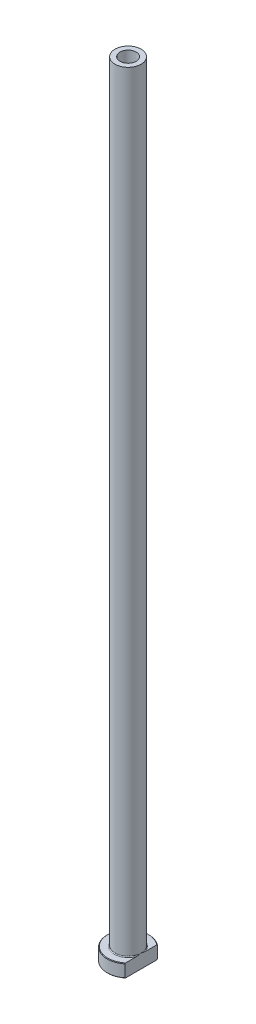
ISO-10303-21;
HEADER;
FILE_DESCRIPTION(('STEP AP214'),'2;1');
FILE_NAME('part.step','',(''),(''),'','','');
FILE_SCHEMA(('AUTOMOTIVE_DESIGN { 1 0 10303 214 1 1 1 1 }'));
ENDSEC;
DATA;
#1=APPLICATION_CONTEXT('core data for automotive mechanical design processes');
#2=APPLICATION_PROTOCOL_DEFINITION('international standard','automotive_design',2000,#1);
#3=PRODUCT_CONTEXT('',#1,'mechanical');
#4=PRODUCT('Part','Part','',(#3));
#5=PRODUCT_RELATED_PRODUCT_CATEGORY('part','',(#4));
#6=PRODUCT_DEFINITION_FORMATION('','',#4);
#7=PRODUCT_DEFINITION_CONTEXT('part definition',#1,'design');
#8=PRODUCT_DEFINITION('design','',#6,#7);
#9=PRODUCT_DEFINITION_SHAPE('','',#8);
#10=(LENGTH_UNIT() NAMED_UNIT(*) SI_UNIT(.MILLI.,.METRE.));
#11=(NAMED_UNIT(*) PLANE_ANGLE_UNIT() SI_UNIT($,.RADIAN.));
#12=(NAMED_UNIT(*) SI_UNIT($,.STERADIAN.) SOLID_ANGLE_UNIT());
#13=UNCERTAINTY_MEASURE_WITH_UNIT(LENGTH_MEASURE(1.E-05),#10,'distance_accuracy_value','');
#14=(GEOMETRIC_REPRESENTATION_CONTEXT(3) GLOBAL_UNCERTAINTY_ASSIGNED_CONTEXT((#13)) GLOBAL_UNIT_ASSIGNED_CONTEXT((#10,
#11,#12)) REPRESENTATION_CONTEXT('',''));
#15=CARTESIAN_POINT('',(0.,0.,0.));
#16=DIRECTION('',(0.,0.,1.));
#17=DIRECTION('',(1.,0.,0.));
#18=AXIS2_PLACEMENT_3D('',#15,#16,#17);
#19=CARTESIAN_POINT('',(0.,92.1876809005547,0.));
#20=DIRECTION('',(0.,1.,0.));
#21=DIRECTION('',(0.,0.,1.));
#22=AXIS2_PLACEMENT_3D('',#19,#20,#21);
#23=CYLINDRICAL_SURFACE('',#22,3.10000000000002);
#24=CARTESIAN_POINT('',(0.,300.,0.));
#25=DIRECTION('',(0.,1.,0.));
#26=DIRECTION('',(0.,0.,1.));
#27=AXIS2_PLACEMENT_3D('',#24,#25,#26);
#28=CIRCLE('',#27,3.10000000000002);
#29=CARTESIAN_POINT('',(0.,300.,3.10000000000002));
#30=VERTEX_POINT('',#29);
#31=EDGE_CURVE('E167',#30,#30,#28,.T.);
#32=ORIENTED_EDGE('',*,*,#31,.T.);
#33=EDGE_LOOP('',(#32));
#34=FACE_BOUND('',#33,.T.);
#35=CARTESIAN_POINT('',(0.,255.,0.));
#36=DIRECTION('',(0.,1.,0.));
#37=DIRECTION('',(0.,0.,1.));
#38=AXIS2_PLACEMENT_3D('',#35,#36,#37);
#39=CIRCLE('',#38,3.10000000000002);
#40=CARTESIAN_POINT('',(0.,255.,3.10000000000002));
#41=VERTEX_POINT('',#40);
#42=EDGE_CURVE('E170',#41,#41,#39,.T.);
#43=ORIENTED_EDGE('',*,*,#42,.F.);
#44=EDGE_LOOP('',(#43));
#45=FACE_BOUND('',#44,.T.);
#46=ADVANCED_FACE('F32',(#34,#45),#23,.F.);
#47=CARTESIAN_POINT('',(-3.10000000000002,300.,0.));
#48=DIRECTION('',(0.,1.,0.));
#49=DIRECTION('',(0.,0.,1.));
#50=AXIS2_PLACEMENT_3D('',#47,#48,#49);
#51=PLANE('',#50);
#52=CARTESIAN_POINT('',(0.,300.,0.));
#53=DIRECTION('',(0.,1.,0.));
#54=DIRECTION('',(0.,0.,1.));
#55=AXIS2_PLACEMENT_3D('',#52,#53,#54);
#56=CIRCLE('',#55,5.00000000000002);
#57=CARTESIAN_POINT('',(0.,300.,5.00000000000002));
#58=VERTEX_POINT('',#57);
#59=EDGE_CURVE('E174',#58,#58,#56,.T.);
#60=ORIENTED_EDGE('',*,*,#59,.T.);
#61=EDGE_LOOP('',(#60));
#62=FACE_BOUND('',#61,.T.);
#63=ORIENTED_EDGE('',*,*,#31,.F.);
#64=EDGE_LOOP('',(#63));
#65=FACE_BOUND('',#64,.T.);
#66=ADVANCED_FACE('F157',(#62,#65),#51,.T.);
#67=CARTESIAN_POINT('',(0.,92.1876809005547,0.));
#68=DIRECTION('',(0.,1.,0.));
#69=DIRECTION('',(0.,0.,1.));
#70=AXIS2_PLACEMENT_3D('',#67,#68,#69);
#71=CYLINDRICAL_SURFACE('',#70,5.00000000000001);
#72=CARTESIAN_POINT('',(0.,5.3,0.));
#73=DIRECTION('',(0.,1.,0.));
#74=DIRECTION('',(0.,0.,1.));
#75=AXIS2_PLACEMENT_3D('',#72,#73,#74);
#76=CIRCLE('',#75,5.00000000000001);
#77=CARTESIAN_POINT('',(5.,5.3,0.));
#78=VERTEX_POINT('',#77);
#79=EDGE_CURVE('E180',#78,#78,#76,.T.);
#80=ORIENTED_EDGE('',*,*,#79,.T.);
#81=EDGE_LOOP('',(#80));
#82=FACE_BOUND('',#81,.T.);
#83=ORIENTED_EDGE('',*,*,#59,.F.);
#84=EDGE_LOOP('',(#83));
#85=FACE_BOUND('',#84,.T.);
#86=ADVANCED_FACE('F162',(#82,#85),#71,.T.);
#87=CARTESIAN_POINT('',(-4.99999999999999,5.,0.));
#88=DIRECTION('',(0.,1.,0.));
#89=DIRECTION('',(0.,0.,1.));
#90=AXIS2_PLACEMENT_3D('',#87,#88,#89);
#91=PLANE('',#90);
#92=DIRECTION('',(0.,0.,1.));
#93=VECTOR('',#92,1.);
#94=CARTESIAN_POINT('',(5.,5.,0.));
#95=LINE('',#94,#93);
#96=CARTESIAN_POINT('',(5.,5.,-5.98665181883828));
#97=VERTEX_POINT('',#96);
#98=CARTESIAN_POINT('',(5.,5.,-1.75783958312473));
#99=VERTEX_POINT('',#98);
#100=EDGE_CURVE('E54',#97,#99,#95,.T.);
#101=ORIENTED_EDGE('',*,*,#100,.F.);
#102=CARTESIAN_POINT('',(0.,5.,0.));
#103=DIRECTION('',(0.,1.,0.));
#104=DIRECTION('',(0.,0.,1.));
#105=AXIS2_PLACEMENT_3D('',#102,#103,#104);
#106=CIRCLE('',#105,7.79999999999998);
#107=CARTESIAN_POINT('',(4.99999999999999,5.,5.98665181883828));
#108=VERTEX_POINT('',#107);
#109=EDGE_CURVE('E186',#97,#108,#106,.T.);
#110=ORIENTED_EDGE('',*,*,#109,.T.);
#111=CARTESIAN_POINT('',(5.,5.,1.75783958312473));
#112=VERTEX_POINT('',#111);
#113=EDGE_CURVE('E134',#112,#108,#95,.T.);
#114=ORIENTED_EDGE('',*,*,#113,.F.);
#115=CARTESIAN_POINT('',(0.,5.,0.));
#116=DIRECTION('',(0.,1.,0.));
#117=DIRECTION('',(0.,0.,1.));
#118=AXIS2_PLACEMENT_3D('',#115,#116,#117);
#119=CIRCLE('',#118,5.30000000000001);
#120=EDGE_CURVE('E183',#112,#99,#119,.F.);
#121=ORIENTED_EDGE('',*,*,#120,.T.);
#122=EDGE_LOOP('',(#101,#110,#114,#121));
#123=FACE_BOUND('',#122,.T.);
#124=ADVANCED_FACE('F197',(#123),#91,.T.);
#125=CARTESIAN_POINT('',(0.,92.1876809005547,0.));
#126=DIRECTION('',(0.,1.,0.));
#127=DIRECTION('',(0.,0.,1.));
#128=AXIS2_PLACEMENT_3D('',#125,#126,#127);
#129=CYLINDRICAL_SURFACE('',#128,7.99999999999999);
#130=DIRECTION('',(0.,-1.,0.));
#131=VECTOR('',#130,1.);
#132=CARTESIAN_POINT('',(4.99999999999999,300.,6.24499799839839));
#133=LINE('',#132,#131);
#134=CARTESIAN_POINT('',(4.99999999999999,4.79999999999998,6.24499799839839));
#135=VERTEX_POINT('',#134);
#136=CARTESIAN_POINT('',(4.99999999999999,0.199999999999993,6.24499799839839));
#137=VERTEX_POINT('',#136);
#138=EDGE_CURVE('E82',#135,#137,#133,.T.);
#139=ORIENTED_EDGE('',*,*,#138,.F.);
#140=CARTESIAN_POINT('',(0.,4.79999999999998,0.));
#141=DIRECTION('',(0.,1.,0.));
#142=DIRECTION('',(0.,0.,1.));
#143=AXIS2_PLACEMENT_3D('',#140,#141,#142);
#144=CIRCLE('',#143,7.99999999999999);
#145=CARTESIAN_POINT('',(5.,4.79999999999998,-6.24499799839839));
#146=VERTEX_POINT('',#145);
#147=EDGE_CURVE('E95',#135,#146,#144,.F.);
#148=ORIENTED_EDGE('',*,*,#147,.T.);
#149=DIRECTION('',(0.,-1.,0.));
#150=VECTOR('',#149,1.);
#151=CARTESIAN_POINT('',(5.,300.,-6.24499799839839));
#152=LINE('',#151,#150);
#153=CARTESIAN_POINT('',(5.,0.199999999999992,-6.24499799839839));
#154=VERTEX_POINT('',#153);
#155=EDGE_CURVE('E192',#146,#154,#152,.T.);
#156=ORIENTED_EDGE('',*,*,#155,.T.);
#157=CARTESIAN_POINT('',(0.,0.199999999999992,0.));
#158=DIRECTION('',(0.,-1.,0.));
#159=DIRECTION('',(0.,0.,-1.));
#160=AXIS2_PLACEMENT_3D('',#157,#158,#159);
#161=CIRCLE('',#160,7.99999999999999);
#162=EDGE_CURVE('E98',#154,#137,#161,.F.);
#163=ORIENTED_EDGE('',*,*,#162,.T.);
#164=EDGE_LOOP('',(#139,#148,#156,#163));
#165=FACE_BOUND('',#164,.T.);
#166=ADVANCED_FACE('F190',(#165),#129,.T.);
#167=CARTESIAN_POINT('',(-7.99999999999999,0.,0.));
#168=DIRECTION('',(0.,-1.,0.));
#169=DIRECTION('',(0.,0.,-1.));
#170=AXIS2_PLACEMENT_3D('',#167,#168,#169);
#171=PLANE('',#170);
#172=CARTESIAN_POINT('',(0.,0.,0.));
#173=DIRECTION('',(0.,-1.,0.));
#174=DIRECTION('',(0.,0.,-1.));
#175=AXIS2_PLACEMENT_3D('',#172,#173,#174);
#176=CIRCLE('',#175,3.84999999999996);
#177=CARTESIAN_POINT('',(0.,0.,-3.84999999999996));
#178=VERTEX_POINT('',#177);
#179=EDGE_CURVE('E40',#178,#178,#176,.F.);
#180=ORIENTED_EDGE('',*,*,#179,.T.);
#181=EDGE_LOOP('',(#180));
#182=FACE_BOUND('',#181,.T.);
#183=DIRECTION('',(0.,0.,-1.));
#184=VECTOR('',#183,1.);
#185=CARTESIAN_POINT('',(4.99999999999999,0.,6.24499799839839));
#186=LINE('',#185,#184);
#187=CARTESIAN_POINT('',(4.99999999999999,0.,5.98665181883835));
#188=VERTEX_POINT('',#187);
#189=CARTESIAN_POINT('',(5.,0.,-5.98665181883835));
#190=VERTEX_POINT('',#189);
#191=EDGE_CURVE('E47',#188,#190,#186,.T.);
#192=ORIENTED_EDGE('',*,*,#191,.F.);
#193=CARTESIAN_POINT('',(0.,0.,0.));
#194=DIRECTION('',(0.,-1.,0.));
#195=DIRECTION('',(0.,0.,-1.));
#196=AXIS2_PLACEMENT_3D('',#193,#194,#195);
#197=CIRCLE('',#196,7.80000000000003);
#198=EDGE_CURVE('E92',#188,#190,#197,.T.);
#199=ORIENTED_EDGE('',*,*,#198,.T.);
#200=EDGE_LOOP('',(#192,#199));
#201=FACE_BOUND('',#200,.T.);
#202=ADVANCED_FACE('F91',(#182,#201),#171,.T.);
#203=CARTESIAN_POINT('',(0.,92.1876809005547,0.));
#204=DIRECTION('',(0.,1.,0.));
#205=DIRECTION('',(0.,0.,1.));
#206=AXIS2_PLACEMENT_3D('',#203,#204,#205);
#207=CYLINDRICAL_SURFACE('',#206,3.35);
#208=CARTESIAN_POINT('',(0.,0.499999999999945,0.));
#209=DIRECTION('',(0.,-1.,0.));
#210=DIRECTION('',(0.,0.,-1.));
#211=AXIS2_PLACEMENT_3D('',#208,#209,#210);
#212=CIRCLE('',#211,3.35);
#213=CARTESIAN_POINT('',(0.,0.499999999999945,-3.35));
#214=VERTEX_POINT('',#213);
#215=EDGE_CURVE('E11',#214,#214,#212,.T.);
#216=ORIENTED_EDGE('',*,*,#215,.T.);
#217=EDGE_LOOP('',(#216));
#218=FACE_BOUND('',#217,.T.);
#219=CARTESIAN_POINT('',(0.,243.,0.));
#220=DIRECTION('',(0.,1.,0.));
#221=DIRECTION('',(0.,0.,1.));
#222=AXIS2_PLACEMENT_3D('',#219,#220,#221);
#223=CIRCLE('',#222,3.35000000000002);
#224=CARTESIAN_POINT('',(0.,243.,3.35000000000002));
#225=VERTEX_POINT('',#224);
#226=EDGE_CURVE('E172',#225,#225,#223,.T.);
#227=ORIENTED_EDGE('',*,*,#226,.T.);
#228=EDGE_LOOP('',(#227));
#229=FACE_BOUND('',#228,.T.);
#230=ADVANCED_FACE('F215',(#218,#229),#207,.F.);
#231=CARTESIAN_POINT('',(0.,243.,0.));
#232=DIRECTION('',(0.,-1.,0.));
#233=DIRECTION('',(0.,0.,-1.));
#234=AXIS2_PLACEMENT_3D('',#231,#232,#233);
#235=CONICAL_SURFACE('',#234,3.35000000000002,0.0208303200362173);
#236=ORIENTED_EDGE('',*,*,#42,.T.);
#237=EDGE_LOOP('',(#236));
#238=FACE_BOUND('',#237,.T.);
#239=ORIENTED_EDGE('',*,*,#226,.F.);
#240=EDGE_LOOP('',(#239));
#241=FACE_BOUND('',#240,.T.);
#242=ADVANCED_FACE('F111',(#238,#241),#235,.F.);
#243=CARTESIAN_POINT('',(0.,5.3,0.));
#244=DIRECTION('',(0.,1.,0.));
#245=DIRECTION('',(0.,0.,1.));
#246=AXIS2_PLACEMENT_3D('',#243,#244,#245);
#247=TOROIDAL_SURFACE('',#246,5.30000000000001,0.3);
#248=ORIENTED_EDGE('',*,*,#120,.F.);
#249=CARTESIAN_POINT('',(5.,5.3,0.));
#250=CARTESIAN_POINT('',(5.,5.30000062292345,-1.31469010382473E-10));
#251=CARTESIAN_POINT('',(5.,5.30000124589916,2.52759437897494E-07));
#252=CARTESIAN_POINT('',(5.,5.30000240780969,9.47164796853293E-07));
#253=CARTESIAN_POINT('',(5.,5.30000293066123,1.40594088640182E-06));
#254=CARTESIAN_POINT('',(5.,5.30000402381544,2.50637678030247E-06));
#255=CARTESIAN_POINT('',(5.,5.30000457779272,3.16588995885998E-06));
#256=CARTESIAN_POINT('',(5.,5.3000055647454,4.52860063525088E-06));
#257=CARTESIAN_POINT('',(5.,5.30000600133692,5.22939539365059E-06));
#258=CARTESIAN_POINT('',(5.,5.30000763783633,7.96122138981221E-06));
#259=CARTESIAN_POINT('',(5.,5.30000875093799,1.00477429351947E-05));
#260=CARTESIAN_POINT('',(5.,5.30001056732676,1.41660896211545E-05));
#261=CARTESIAN_POINT('',(5.,5.30001129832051,1.61861803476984E-05));
#262=CARTESIAN_POINT('',(5.,5.30001439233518,2.47865774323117E-05));
#263=CARTESIAN_POINT('',(5.,5.30001672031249,3.13830329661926E-05));
#264=CARTESIAN_POINT('',(5.,5.30002012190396,4.38084273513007E-05));
#265=CARTESIAN_POINT('',(5.,5.30002133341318,4.95992786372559E-05));
#266=CARTESIAN_POINT('',(4.99999999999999,5.30003020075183,9.27862687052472E-05));
#267=CARTESIAN_POINT('',(5.,5.30003696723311,0.000130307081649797));
#268=CARTESIAN_POINT('',(5.,5.30006659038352,0.000278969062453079));
#269=CARTESIAN_POINT('',(5.,5.30009481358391,0.000389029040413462));
#270=CARTESIAN_POINT('',(4.99999999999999,5.30020506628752,0.000826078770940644));
#271=CARTESIAN_POINT('',(5.,5.30028365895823,0.00115365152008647));
#272=CARTESIAN_POINT('',(5.,5.30059919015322,0.00245925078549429));
#273=CARTESIAN_POINT('',(5.,5.3008404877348,0.00343651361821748));
#274=CARTESIAN_POINT('',(4.99999999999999,5.30184626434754,0.00752058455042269));
#275=CARTESIAN_POINT('',(4.99999999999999,5.30260525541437,0.0106283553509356));
#276=CARTESIAN_POINT('',(5.,5.30996461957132,0.0407482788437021));
#277=CARTESIAN_POINT('',(5.,5.31658985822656,0.0677561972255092));
#278=CARTESIAN_POINT('',(4.99999999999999,5.32953319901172,0.120688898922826));
#279=CARTESIAN_POINT('',(5.,5.33585289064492,0.146613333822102));
#280=CARTESIAN_POINT('',(5.,5.34926050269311,0.20179565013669));
#281=CARTESIAN_POINT('',(5.,5.35634306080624,0.231054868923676));
#282=CARTESIAN_POINT('',(5.,5.37050252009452,0.289917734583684));
#283=CARTESIAN_POINT('',(5.,5.37757848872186,0.319521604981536));
#284=CARTESIAN_POINT('',(5.,5.39452602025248,0.391032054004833));
#285=CARTESIAN_POINT('',(5.,5.40434071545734,0.432952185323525));
#286=CARTESIAN_POINT('',(5.,5.42340141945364,0.515763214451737));
#287=CARTESIAN_POINT('',(5.,5.43265559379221,0.556652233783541));
#288=CARTESIAN_POINT('',(5.,5.45710553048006,0.667075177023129));
#289=CARTESIAN_POINT('',(5.,5.47194176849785,0.736689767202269));
#290=CARTESIAN_POINT('',(5.,5.5001822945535,0.876836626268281));
#291=CARTESIAN_POINT('',(5.,5.51357312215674,0.947371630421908));
#292=CARTESIAN_POINT('',(5.,5.53930921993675,1.0949732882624));
#293=CARTESIAN_POINT('',(5.,5.5514621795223,1.17207432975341));
#294=CARTESIAN_POINT('',(5.,5.57239669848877,1.32672649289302));
#295=CARTESIAN_POINT('',(5.,5.58117877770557,1.40427754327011));
#296=CARTESIAN_POINT('',(5.,5.59499725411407,1.56873827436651));
#297=CARTESIAN_POINT('',(5.,5.59948802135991,1.65570044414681));
#298=CARTESIAN_POINT('',(5.,5.60018885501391,1.78535304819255));
#299=CARTESIAN_POINT('',(5.,5.59945214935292,1.82802575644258));
#300=CARTESIAN_POINT('',(5.,5.59559364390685,1.91325081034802));
#301=CARTESIAN_POINT('',(5.,5.59247319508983,1.95580321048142));
#302=CARTESIAN_POINT('',(5.,5.58383242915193,2.03512365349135));
#303=CARTESIAN_POINT('',(5.,5.57867386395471,2.07192937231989));
#304=CARTESIAN_POINT('',(5.,5.56543793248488,2.14526756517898));
#305=CARTESIAN_POINT('',(5.,5.55734203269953,2.18179676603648));
#306=CARTESIAN_POINT('',(5.,5.53718005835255,2.25427226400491));
#307=CARTESIAN_POINT('',(5.,5.52507057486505,2.29020746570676));
#308=CARTESIAN_POINT('',(5.,5.50270928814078,2.34223029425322));
#309=CARTESIAN_POINT('',(5.,5.4945781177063,2.35922314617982));
#310=CARTESIAN_POINT('',(5.,5.47657809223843,2.39224900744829));
#311=CARTESIAN_POINT('',(5.,5.4667128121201,2.40828390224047));
#312=CARTESIAN_POINT('',(5.,5.44695893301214,2.4357946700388));
#313=CARTESIAN_POINT('',(5.,5.43745879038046,2.44754592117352));
#314=CARTESIAN_POINT('',(5.,5.41677914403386,2.46946476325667));
#315=CARTESIAN_POINT('',(5.,5.40560543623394,2.47963758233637));
#316=CARTESIAN_POINT('',(5.,5.38617750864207,2.49393642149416));
#317=CARTESIAN_POINT('',(5.,5.37851643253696,2.49886271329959));
#318=CARTESIAN_POINT('',(5.,5.36252740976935,2.50749953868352));
#319=CARTESIAN_POINT('',(5.,5.35419984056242,2.51121075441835));
#320=CARTESIAN_POINT('',(5.,5.33690648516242,2.51712941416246));
#321=CARTESIAN_POINT('',(5.,5.32793451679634,2.51931927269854));
#322=CARTESIAN_POINT('',(5.,5.3097357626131,2.52185978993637));
#323=CARTESIAN_POINT('',(5.,5.30050931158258,2.52221275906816));
#324=CARTESIAN_POINT('',(5.,5.28349166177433,2.52112455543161));
#325=CARTESIAN_POINT('',(5.,5.2756832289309,2.51993178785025));
#326=CARTESIAN_POINT('',(5.,5.26036860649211,2.51628294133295));
#327=CARTESIAN_POINT('',(5.,5.25286261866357,2.51382603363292));
#328=CARTESIAN_POINT('',(5.,5.23590266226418,2.50685484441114));
#329=CARTESIAN_POINT('',(5.,5.22661875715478,2.50192984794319));
#330=CARTESIAN_POINT('',(5.,5.20895514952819,2.49066548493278));
#331=CARTESIAN_POINT('',(5.,5.20057756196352,2.48432291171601));
#332=CARTESIAN_POINT('',(5.,5.17987008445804,2.46645212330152));
#333=CARTESIAN_POINT('',(5.,5.16824151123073,2.45411867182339));
#334=CARTESIAN_POINT('',(5.,5.14692461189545,2.42790849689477));
#335=CARTESIAN_POINT('',(5.,5.13723987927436,2.41402898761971));
#336=CARTESIAN_POINT('',(5.,5.11080706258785,2.37143175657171));
#337=CARTESIAN_POINT('',(5.,5.09628770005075,2.34134703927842));
#338=CARTESIAN_POINT('',(5.,5.07130349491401,2.27940731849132));
#339=CARTESIAN_POINT('',(5.,5.06087110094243,2.24754035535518));
#340=CARTESIAN_POINT('',(5.,5.03890359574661,2.16787245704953));
#341=CARTESIAN_POINT('',(5.,5.02913523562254,2.11959065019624));
#342=CARTESIAN_POINT('',(5.,5.01416953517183,2.02224928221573));
#343=CARTESIAN_POINT('',(5.,5.00898637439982,1.97318778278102));
#344=CARTESIAN_POINT('',(5.,5.00220823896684,1.87635767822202));
#345=CARTESIAN_POINT('',(5.,5.00050709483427,1.82859609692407));
#346=CARTESIAN_POINT('',(5.,4.99969104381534,1.73330165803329));
#347=CARTESIAN_POINT('',(5.,5.00056327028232,1.6857688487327));
#348=CARTESIAN_POINT('',(5.,5.00484296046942,1.57937770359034));
#349=CARTESIAN_POINT('',(5.,5.00880932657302,1.52054285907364));
#350=CARTESIAN_POINT('',(5.,5.01925964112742,1.40312974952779));
#351=CARTESIAN_POINT('',(5.,5.0257426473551,1.34455139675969));
#352=CARTESIAN_POINT('',(5.,5.04090087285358,1.22627662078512));
#353=CARTESIAN_POINT('',(5.,5.0496242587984,1.16658647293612));
#354=CARTESIAN_POINT('',(5.,5.06877923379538,1.04732463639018));
#355=CARTESIAN_POINT('',(5.,5.07921523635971,0.987753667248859));
#356=CARTESIAN_POINT('',(5.,5.10551698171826,0.846936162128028));
#357=CARTESIAN_POINT('',(5.,5.12196565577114,0.765799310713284));
#358=CARTESIAN_POINT('',(5.,5.15639716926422,0.604819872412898));
#359=CARTESIAN_POINT('',(4.99999999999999,5.17436050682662,0.52497303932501));
#360=CARTESIAN_POINT('',(5.,5.20921667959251,0.374726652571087));
#361=CARTESIAN_POINT('',(5.,5.225993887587,0.304300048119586));
#362=CARTESIAN_POINT('',(4.99999999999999,5.25191105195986,0.196907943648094));
#363=CARTESIAN_POINT('',(4.99999999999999,5.26090146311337,0.159905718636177));
#364=CARTESIAN_POINT('',(5.,5.27881854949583,0.0865164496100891));
#365=CARTESIAN_POINT('',(5.00000000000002,5.28774391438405,0.0501291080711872));
#366=CARTESIAN_POINT('',(4.99999999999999,5.2973962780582,0.0106218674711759));
#367=CARTESIAN_POINT('',(4.99999999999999,5.29815688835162,0.00750762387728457));
#368=CARTESIAN_POINT('',(5.,5.29916304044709,0.00342209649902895));
#369=CARTESIAN_POINT('',(5.,5.29940309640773,0.00244985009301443));
#370=CARTESIAN_POINT('',(4.99999999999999,5.29971711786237,0.00115049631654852));
#371=CARTESIAN_POINT('',(4.99999999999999,5.29979541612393,0.000824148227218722));
#372=CARTESIAN_POINT('',(5.,5.29990531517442,0.000388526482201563));
#373=CARTESIAN_POINT('',(5.,5.29993348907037,0.000278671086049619));
#374=CARTESIAN_POINT('',(4.99999999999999,5.29996306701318,0.000130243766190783));
#375=CARTESIAN_POINT('',(4.99999999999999,5.2999698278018,9.27511452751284E-05));
#376=CARTESIAN_POINT('',(5.,5.29997868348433,4.95929937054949E-05));
#377=CARTESIAN_POINT('',(5.,5.2999798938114,4.38036608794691E-05));
#378=CARTESIAN_POINT('',(5.,5.29998329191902,3.13814231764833E-05));
#379=CARTESIAN_POINT('',(5.,5.29998561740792,2.47865253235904E-05));
#380=CARTESIAN_POINT('',(5.,5.29998870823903,1.61877567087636E-05));
#381=CARTESIAN_POINT('',(5.,5.29998943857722,1.41677791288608E-05));
#382=CARTESIAN_POINT('',(5.,5.29999125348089,1.00495550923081E-05));
#383=CARTESIAN_POINT('',(5.,5.29999236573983,7.96302814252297E-06));
#384=CARTESIAN_POINT('',(5.,5.29999400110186,5.23107510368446E-06));
#385=CARTESIAN_POINT('',(5.,5.2999944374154,4.53021132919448E-06));
#386=CARTESIAN_POINT('',(5.,5.29999542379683,3.16731243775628E-06));
#387=CARTESIAN_POINT('',(5.,5.29999597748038,2.50767799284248E-06));
#388=CARTESIAN_POINT('',(5.,5.29999707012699,1.40695930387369E-06));
#389=CARTESIAN_POINT('',(5.,5.29999759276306,9.48032903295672E-07));
#390=CARTESIAN_POINT('',(5.,5.29999875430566,2.53244546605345E-07));
#391=CARTESIAN_POINT('',(5.,5.29999937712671,1.31459812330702E-10));
#392=CARTESIAN_POINT('',(5.,5.3,0.));
#393=B_SPLINE_CURVE_WITH_KNOTS('',3,(#249,#250,#251,#252,#253,#254,#255,#256,#257,#258,#259,
#260,#261,#262,#263,#264,#265,#266,#267,#268,#269,#270,#271,#272,#273,#274,#275,#276,#277,#278,
#279,#280,#281,#282,#283,#284,#285,#286,#287,#288,#289,#290,#291,#292,#293,#294,#295,#296,#297,
#298,#299,#300,#301,#302,#303,#304,#305,#306,#307,#308,#309,#310,#311,#312,#313,#314,#315,#316,
#317,#318,#319,#320,#321,#322,#323,#324,#325,#326,#327,#328,#329,#330,#331,#332,#333,#334,#335,
#336,#337,#338,#339,#340,#341,#342,#343,#344,#345,#346,#347,#348,#349,#350,#351,#352,#353,#354,
#355,#356,#357,#358,#359,#360,#361,#362,#363,#364,#365,#366,#367,#368,#369,#370,#371,#372,#373,
#374,#375,#376,#377,#378,#379,#380,#381,#382,#383,#384,#385,#386,#387,#388,#389,#390,#391,#392),
.UNSPECIFIED.,.T.,.F.,(4,2,2,2,2,2,2,2,2,2,2,2,2,2,2,2,2,2,2,2,2,2,2,2,2,2,2,2,2,2,2,2,2,2,2,2,
2,2,2,2,2,2,2,2,2,2,2,2,2,2,2,2,2,2,2,2,2,2,2,2,2,2,2,2,2,2,2,2,2,2,2,4),(0.,
1.88939046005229E-06,3.98058434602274E-06,6.54817954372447E-06,9.02403619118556E-06,
1.60938663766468E-05,2.25328087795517E-05,4.34843817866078E-05,6.12120063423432E-05,
0.00017562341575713,0.000516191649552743,0.00152710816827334,0.00454656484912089,
0.0141443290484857,0.0975679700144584,0.17761933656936,0.267931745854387,0.359245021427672,
0.488405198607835,0.614173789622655,0.827694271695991,1.04305715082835,1.27715608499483,
1.51121890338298,1.77214751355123,1.90013509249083,2.02805018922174,2.13945459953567,
2.25157451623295,2.3649489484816,2.42139235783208,2.47772074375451,2.5229380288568,
2.56800219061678,2.59524342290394,2.62246933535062,2.65000494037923,2.67750590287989,
2.70108948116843,2.72468854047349,2.75603978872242,2.78746268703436,2.83802806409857,
2.88868607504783,2.98834295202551,3.08877575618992,3.23618650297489,3.38405153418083,
3.52733651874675,3.66990630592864,3.84673903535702,4.02350562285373,4.20444776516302,
4.38586374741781,4.63419556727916,4.87971270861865,5.09690175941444,5.21113882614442,
5.32353360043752,5.33315137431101,5.33615533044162,5.33716246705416,5.33750240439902,
5.3376167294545,5.33763445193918,5.33765539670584,5.33766183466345,5.33766890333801,
5.33767137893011,5.33767394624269,5.33767603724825,5.33767792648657),.UNSPECIFIED.);
#394=EDGE_CURVE('E126',#112,#78,#393,.T.);
#395=ORIENTED_EDGE('',*,*,#394,.T.);
#396=ORIENTED_EDGE('',*,*,#79,.F.);
#397=CARTESIAN_POINT('',(5.,5.3,0.));
#398=CARTESIAN_POINT('',(5.,5.29999937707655,1.31470487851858E-10));
#399=CARTESIAN_POINT('',(5.,5.29999875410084,-2.52759436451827E-07));
#400=CARTESIAN_POINT('',(5.,5.29999759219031,-9.47164795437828E-07));
#401=CARTESIAN_POINT('',(5.,5.29999706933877,-1.40594088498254E-06));
#402=CARTESIAN_POINT('',(5.,5.29999597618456,-2.50637677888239E-06));
#403=CARTESIAN_POINT('',(5.,5.29999542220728,-3.16588995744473E-06));
#404=CARTESIAN_POINT('',(5.,5.29999443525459,-4.52860063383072E-06));
#405=CARTESIAN_POINT('',(5.,5.29999399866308,-5.22939539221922E-06));
#406=CARTESIAN_POINT('',(5.,5.29999236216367,-7.96122138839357E-06));
#407=CARTESIAN_POINT('',(5.,5.299991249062,-1.00477429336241E-05));
#408=CARTESIAN_POINT('',(5.,5.29998943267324,-1.4166089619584E-05));
#409=CARTESIAN_POINT('',(5.,5.29998870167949,-1.61861803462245E-05));
#410=CARTESIAN_POINT('',(5.,5.29998560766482,-2.47865774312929E-05));
#411=CARTESIAN_POINT('',(5.,5.29998327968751,-3.13830329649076E-05));
#412=CARTESIAN_POINT('',(5.,5.29997987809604,-4.38084273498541E-05));
#413=CARTESIAN_POINT('',(5.,5.29997866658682,-4.95992786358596E-05));
#414=CARTESIAN_POINT('',(5.,5.29996979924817,-9.27862687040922E-05));
#415=CARTESIAN_POINT('',(5.,5.29996303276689,-0.00013030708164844));
#416=CARTESIAN_POINT('',(4.99999999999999,5.29993340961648,-0.000278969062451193));
#417=CARTESIAN_POINT('',(4.99999999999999,5.29990518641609,-0.000389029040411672));
#418=CARTESIAN_POINT('',(5.,5.29979493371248,-0.000826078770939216));
#419=CARTESIAN_POINT('',(5.,5.29971634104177,-0.00115365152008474));
#420=CARTESIAN_POINT('',(4.99999999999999,5.29940080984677,-0.00245925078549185));
#421=CARTESIAN_POINT('',(4.99999999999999,5.29915951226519,-0.00343651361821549));
#422=CARTESIAN_POINT('',(5.00000000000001,5.29815373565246,-0.00752058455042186));
#423=CARTESIAN_POINT('',(5.,5.29739474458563,-0.0106283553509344));
#424=CARTESIAN_POINT('',(4.99999999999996,5.29003538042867,-0.0407482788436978));
#425=CARTESIAN_POINT('',(4.99999999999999,5.28341014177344,-0.0677561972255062));
#426=CARTESIAN_POINT('',(5.00000000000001,5.27046680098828,-0.120688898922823));
#427=CARTESIAN_POINT('',(5.,5.26414710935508,-0.146613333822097));
#428=CARTESIAN_POINT('',(4.99999999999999,5.25073949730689,-0.201795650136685));
#429=CARTESIAN_POINT('',(4.99999999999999,5.24365693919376,-0.231054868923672));
#430=CARTESIAN_POINT('',(5.,5.22949747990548,-0.289917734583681));
#431=CARTESIAN_POINT('',(5.,5.22242151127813,-0.319521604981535));
#432=CARTESIAN_POINT('',(5.,5.20547397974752,-0.391032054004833));
#433=CARTESIAN_POINT('',(5.,5.19565928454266,-0.432952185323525));
#434=CARTESIAN_POINT('',(5.,5.17659858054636,-0.515763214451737));
#435=CARTESIAN_POINT('',(5.,5.16734440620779,-0.55665223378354));
#436=CARTESIAN_POINT('',(5.,5.14289446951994,-0.667075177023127));
#437=CARTESIAN_POINT('',(5.,5.12805823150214,-0.736689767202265));
#438=CARTESIAN_POINT('',(5.,5.0998177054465,-0.876836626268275));
#439=CARTESIAN_POINT('',(5.,5.08642687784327,-0.947371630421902));
#440=CARTESIAN_POINT('',(5.,5.06069078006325,-1.0949732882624));
#441=CARTESIAN_POINT('',(5.,5.0485378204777,-1.1720743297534));
#442=CARTESIAN_POINT('',(5.,5.02760330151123,-1.32672649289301));
#443=CARTESIAN_POINT('',(5.,5.01882122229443,-1.4042775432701));
#444=CARTESIAN_POINT('',(5.,5.00500274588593,-1.56873827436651));
#445=CARTESIAN_POINT('',(5.,5.00051197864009,-1.6557004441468));
#446=CARTESIAN_POINT('',(5.,4.99981114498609,-1.78535304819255));
#447=CARTESIAN_POINT('',(5.,5.00054785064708,-1.82802575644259));
#448=CARTESIAN_POINT('',(5.,5.00440635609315,-1.91325081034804));
#449=CARTESIAN_POINT('',(5.,5.00752680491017,-1.95580321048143));
#450=CARTESIAN_POINT('',(5.,5.01616757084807,-2.03512365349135));
#451=CARTESIAN_POINT('',(5.,5.02132613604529,-2.0719293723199));
#452=CARTESIAN_POINT('',(5.,5.03456206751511,-2.14526756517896));
#453=CARTESIAN_POINT('',(5.,5.04265796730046,-2.18179676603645));
#454=CARTESIAN_POINT('',(5.,5.06281994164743,-2.25427226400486));
#455=CARTESIAN_POINT('',(5.,5.07492942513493,-2.2902074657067));
#456=CARTESIAN_POINT('',(5.,5.09729071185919,-2.34223029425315));
#457=CARTESIAN_POINT('',(5.,5.10542188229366,-2.35922314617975));
#458=CARTESIAN_POINT('',(5.,5.12342190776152,-2.39224900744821));
#459=CARTESIAN_POINT('',(5.,5.13328718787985,-2.4082839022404));
#460=CARTESIAN_POINT('',(5.,5.1530410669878,-2.43579467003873));
#461=CARTESIAN_POINT('',(5.,5.16254120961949,-2.44754592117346));
#462=CARTESIAN_POINT('',(5.,5.18322085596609,-2.46946476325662));
#463=CARTESIAN_POINT('',(5.,5.19439456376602,-2.47963758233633));
#464=CARTESIAN_POINT('',(5.,5.21382249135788,-2.49393642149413));
#465=CARTESIAN_POINT('',(5.,5.22148356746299,-2.49886271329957));
#466=CARTESIAN_POINT('',(5.,5.2374725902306,-2.50749953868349));
#467=CARTESIAN_POINT('',(5.,5.24580015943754,-2.51121075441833));
#468=CARTESIAN_POINT('',(5.,5.26309351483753,-2.51712941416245));
#469=CARTESIAN_POINT('',(5.,5.27206548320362,-2.51931927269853));
#470=CARTESIAN_POINT('',(5.,5.29026423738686,-2.52185978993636));
#471=CARTESIAN_POINT('',(5.,5.29949068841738,-2.52221275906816));
#472=CARTESIAN_POINT('',(5.,5.31650833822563,-2.52112455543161));
#473=CARTESIAN_POINT('',(5.,5.32431677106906,-2.51993178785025));
#474=CARTESIAN_POINT('',(5.,5.33963139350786,-2.51628294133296));
#475=CARTESIAN_POINT('',(5.,5.3471373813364,-2.51382603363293));
#476=CARTESIAN_POINT('',(5.,5.36409733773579,-2.50685484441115));
#477=CARTESIAN_POINT('',(5.,5.37338124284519,-2.50192984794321));
#478=CARTESIAN_POINT('',(5.,5.39104485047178,-2.4906654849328));
#479=CARTESIAN_POINT('',(5.,5.39942243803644,-2.48432291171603));
#480=CARTESIAN_POINT('',(5.,5.42012991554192,-2.46645212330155));
#481=CARTESIAN_POINT('',(5.,5.43175848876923,-2.45411867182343));
#482=CARTESIAN_POINT('',(5.,5.45307538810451,-2.42790849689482));
#483=CARTESIAN_POINT('',(5.,5.4627601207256,-2.41402898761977));
#484=CARTESIAN_POINT('',(5.,5.48919293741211,-2.37143175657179));
#485=CARTESIAN_POINT('',(5.,5.5037122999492,-2.34134703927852));
#486=CARTESIAN_POINT('',(5.,5.52869650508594,-2.27940731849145));
#487=CARTESIAN_POINT('',(5.,5.53912889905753,-2.24754035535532));
#488=CARTESIAN_POINT('',(5.,5.56109640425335,-2.16787245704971));
#489=CARTESIAN_POINT('',(5.,5.57086476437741,-2.11959065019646));
#490=CARTESIAN_POINT('',(5.,5.58583046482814,-2.02224928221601));
#491=CARTESIAN_POINT('',(5.,5.59101362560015,-1.97318778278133));
#492=CARTESIAN_POINT('',(5.,5.59779176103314,-1.87635767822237));
#493=CARTESIAN_POINT('',(5.,5.59949290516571,-1.82859609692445));
#494=CARTESIAN_POINT('',(5.,5.60030895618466,-1.73330165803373));
#495=CARTESIAN_POINT('',(5.,5.59943672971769,-1.68576884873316));
#496=CARTESIAN_POINT('',(5.,5.5951570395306,-1.57937770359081));
#497=CARTESIAN_POINT('',(5.,5.59119067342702,-1.52054285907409));
#498=CARTESIAN_POINT('',(5.,5.58074035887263,-1.40312974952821));
#499=CARTESIAN_POINT('',(5.,5.57425735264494,-1.34455139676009));
#500=CARTESIAN_POINT('',(5.,5.55909912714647,-1.22627662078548));
#501=CARTESIAN_POINT('',(5.,5.55037574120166,-1.16658647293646));
#502=CARTESIAN_POINT('',(5.,5.53122076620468,-1.04732463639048));
#503=CARTESIAN_POINT('',(5.,5.52078476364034,-0.987753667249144));
#504=CARTESIAN_POINT('',(5.,5.49448301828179,-0.846936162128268));
#505=CARTESIAN_POINT('',(4.99999999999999,5.4780343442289,-0.765799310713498));
#506=CARTESIAN_POINT('',(5.,5.44360283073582,-0.604819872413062));
#507=CARTESIAN_POINT('',(5.,5.42563949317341,-0.52497303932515));
#508=CARTESIAN_POINT('',(4.99999999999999,5.39078332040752,-0.374726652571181));
#509=CARTESIAN_POINT('',(4.99999999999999,5.37400611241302,-0.304300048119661));
#510=CARTESIAN_POINT('',(5.,5.34808894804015,-0.196907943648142));
#511=CARTESIAN_POINT('',(5.00000000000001,5.33909853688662,-0.159905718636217));
#512=CARTESIAN_POINT('',(4.99999999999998,5.32118145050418,-0.0865164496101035));
#513=CARTESIAN_POINT('',(4.99999999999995,5.312256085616,-0.0501291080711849));
#514=CARTESIAN_POINT('',(5.,5.3026037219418,-0.0106218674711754));
#515=CARTESIAN_POINT('',(5.,5.30184311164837,-0.00750762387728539));
#516=CARTESIAN_POINT('',(4.99999999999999,5.3008369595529,-0.00342209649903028));
#517=CARTESIAN_POINT('',(4.99999999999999,5.30059690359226,-0.00244985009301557));
#518=CARTESIAN_POINT('',(5.,5.30028288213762,-0.00115049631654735));
#519=CARTESIAN_POINT('',(5.,5.30020458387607,-0.000824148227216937));
#520=CARTESIAN_POINT('',(4.99999999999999,5.30009468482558,-0.000388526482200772));
#521=CARTESIAN_POINT('',(4.99999999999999,5.30006651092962,-0.000278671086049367));
#522=CARTESIAN_POINT('',(5.,5.30003693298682,-0.000130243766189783));
#523=CARTESIAN_POINT('',(5.,5.3000301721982,-9.27511452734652E-05));
#524=CARTESIAN_POINT('',(5.,5.30002131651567,-4.95929937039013E-05));
#525=CARTESIAN_POINT('',(5.,5.30002010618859,-4.38036608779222E-05));
#526=CARTESIAN_POINT('',(5.,5.30001670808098,-3.13814231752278E-05));
#527=CARTESIAN_POINT('',(5.,5.30001438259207,-2.4786525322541E-05));
#528=CARTESIAN_POINT('',(5.,5.30001129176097,-1.61877567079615E-05));
#529=CARTESIAN_POINT('',(5.,5.30001056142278,-1.41677791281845E-05));
#530=CARTESIAN_POINT('',(5.,5.30000874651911,-1.0049555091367E-05));
#531=CARTESIAN_POINT('',(5.,5.30000763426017,-7.96302814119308E-06));
#532=CARTESIAN_POINT('',(5.,5.30000599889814,-5.23107510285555E-06));
#533=CARTESIAN_POINT('',(5.,5.3000055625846,-4.53021132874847E-06));
#534=CARTESIAN_POINT('',(5.,5.30000457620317,-3.16731243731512E-06));
#535=CARTESIAN_POINT('',(5.,5.30000402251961,-2.50767799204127E-06));
#536=CARTESIAN_POINT('',(5.,5.30000292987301,-1.40695930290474E-06));
#537=CARTESIAN_POINT('',(5.,5.30000240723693,-9.48032902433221E-07));
#538=CARTESIAN_POINT('',(5.,5.30000124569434,-2.53244545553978E-07));
#539=CARTESIAN_POINT('',(5.,5.30000062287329,-1.3145851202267E-10));
#540=CARTESIAN_POINT('',(5.,5.3,0.));
#541=B_SPLINE_CURVE_WITH_KNOTS('',3,(#397,#398,#399,#400,#401,#402,#403,#404,#405,#406,#407,
#408,#409,#410,#411,#412,#413,#414,#415,#416,#417,#418,#419,#420,#421,#422,#423,#424,#425,#426,
#427,#428,#429,#430,#431,#432,#433,#434,#435,#436,#437,#438,#439,#440,#441,#442,#443,#444,#445,
#446,#447,#448,#449,#450,#451,#452,#453,#454,#455,#456,#457,#458,#459,#460,#461,#462,#463,#464,
#465,#466,#467,#468,#469,#470,#471,#472,#473,#474,#475,#476,#477,#478,#479,#480,#481,#482,#483,
#484,#485,#486,#487,#488,#489,#490,#491,#492,#493,#494,#495,#496,#497,#498,#499,#500,#501,#502,
#503,#504,#505,#506,#507,#508,#509,#510,#511,#512,#513,#514,#515,#516,#517,#518,#519,#520,#521,
#522,#523,#524,#525,#526,#527,#528,#529,#530,#531,#532,#533,#534,#535,#536,#537,#538,#539,#540),
.UNSPECIFIED.,.T.,.F.,(4,2,2,2,2,2,2,2,2,2,2,2,2,2,2,2,2,2,2,2,2,2,2,2,2,2,2,2,2,2,2,2,2,2,2,2,
2,2,2,2,2,2,2,2,2,2,2,2,2,2,2,2,2,2,2,2,2,2,2,2,2,2,2,2,2,2,2,2,2,2,2,4),(0.,
1.8893904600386E-06,3.98058434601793E-06,6.54817954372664E-06,9.02403619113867E-06,
1.60938663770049E-05,2.25328087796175E-05,4.34843817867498E-05,6.12120063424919E-05,
0.000175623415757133,0.000516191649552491,0.00152710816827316,0.00454656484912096,
0.0141443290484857,0.0975679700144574,0.177619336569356,0.267931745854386,0.359245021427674,
0.488405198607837,0.614173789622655,0.827694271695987,1.04305715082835,1.27715608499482,
1.51121890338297,1.77214751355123,1.90013509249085,2.02805018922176,2.13945459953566,
2.25157451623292,2.36494894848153,2.421392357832,2.47772074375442,2.52293802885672,
2.56800219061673,2.59524342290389,2.62246933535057,2.65000494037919,2.67750590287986,
2.7010894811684,2.72468854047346,2.75603978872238,2.78746268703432,2.8380280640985,
2.88868607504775,2.98834295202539,3.08877575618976,3.23618650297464,3.38405153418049,
3.52733651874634,3.66990630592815,3.84673903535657,4.02350562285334,4.20444776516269,
4.38586374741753,4.63419556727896,4.87971270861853,5.09690175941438,5.21113882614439,
5.32353360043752,5.33315137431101,5.33615533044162,5.33716246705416,5.33750240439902,
5.3376167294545,5.33763445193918,5.33765539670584,5.33766183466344,5.33766890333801,
5.3376713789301,5.33767394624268,5.33767603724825,5.33767792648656),.UNSPECIFIED.);
#542=EDGE_CURVE('E135',#78,#99,#541,.T.);
#543=ORIENTED_EDGE('',*,*,#542,.T.);
#544=EDGE_LOOP('',(#248,#395,#396,#543));
#545=FACE_BOUND('',#544,.T.);
#546=ADVANCED_FACE('F141',(#545),#247,.F.);
#547=CARTESIAN_POINT('',(0.,5.,0.));
#548=DIRECTION('',(0.,-1.,0.));
#549=DIRECTION('',(0.,0.,-1.));
#550=AXIS2_PLACEMENT_3D('',#547,#548,#549);
#551=CONICAL_SURFACE('',#550,7.79999999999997,0.78539816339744);
#552=CARTESIAN_POINT('',(5.,-1.82162423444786,-13.7401563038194));
#553=CARTESIAN_POINT('',(5.,-1.61889813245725,-13.5244204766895));
#554=CARTESIAN_POINT('',(5.,-1.4164638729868,-13.3084101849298));
#555=CARTESIAN_POINT('',(5.,-1.01227657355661,-12.8757508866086));
#556=CARTESIAN_POINT('',(5.,-0.810523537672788,-12.6591018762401));
#557=CARTESIAN_POINT('',(5.,-0.206157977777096,-12.0077661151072));
#558=CARTESIAN_POINT('',(5.,0.195280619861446,-11.5719884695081));
#559=CARTESIAN_POINT('',(5.,1.00388282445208,-10.6856136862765));
#560=CARTESIAN_POINT('',(5.,1.4109390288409,-10.2349182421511));
#561=CARTESIAN_POINT('',(5.,2.01658324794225,-9.55471676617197));
#562=CARTESIAN_POINT('',(5.,2.21758236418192,-9.32735800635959));
#563=CARTESIAN_POINT('',(5.,2.61761142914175,-8.87091599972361));
#564=CARTESIAN_POINT('',(5.,2.8166413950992,-8.64183276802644));
#565=CARTESIAN_POINT('',(5.,3.21217345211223,-8.18170099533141));
#566=CARTESIAN_POINT('',(5.,3.4086768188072,-7.95065355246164));
#567=CARTESIAN_POINT('',(5.,3.79865427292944,-7.48599989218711));
#568=CARTESIAN_POINT('',(5.,3.9921282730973,-7.25239360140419));
#569=CARTESIAN_POINT('',(5.,4.37558160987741,-6.78155890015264));
#570=CARTESIAN_POINT('',(5.,4.56555334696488,-6.54432428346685));
#571=CARTESIAN_POINT('',(5.,4.94042138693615,-6.06589574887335));
#572=CARTESIAN_POINT('',(5.,5.125318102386,-5.82470215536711));
#573=CARTESIAN_POINT('',(5.,5.48653546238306,-5.33972956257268));
#574=CARTESIAN_POINT('',(5.,5.66292392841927,-5.09600137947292));
#575=CARTESIAN_POINT('',(5.,6.00675382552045,-4.60213647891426));
#576=CARTESIAN_POINT('',(5.,6.1741916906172,-4.35199726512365));
#577=CARTESIAN_POINT('',(5.,6.49592993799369,-3.84445040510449));
#578=CARTESIAN_POINT('',(5.,6.65027272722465,-3.58707012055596));
#579=CARTESIAN_POINT('',(5.,6.86813414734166,-3.19356592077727));
#580=CARTESIAN_POINT('',(5.,6.93845533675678,-3.06120993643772));
#581=CARTESIAN_POINT('',(5.,7.07360441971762,-2.7937331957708));
#582=CARTESIAN_POINT('',(5.,7.13843319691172,-2.65861288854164));
#583=CARTESIAN_POINT('',(5.,7.26869642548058,-2.36936389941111));
#584=CARTESIAN_POINT('',(5.,7.33331212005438,-2.21486278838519));
#585=CARTESIAN_POINT('',(5.,7.45243473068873,-1.90194073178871));
#586=CARTESIAN_POINT('',(5.,7.50694001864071,-1.74351915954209));
#587=CARTESIAN_POINT('',(5.,7.60343746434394,-1.42384276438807));
#588=CARTESIAN_POINT('',(5.,7.64549910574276,-1.26260921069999));
#589=CARTESIAN_POINT('',(5.,7.71543089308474,-0.937062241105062));
#590=CARTESIAN_POINT('',(5.,7.74330266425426,-0.77274918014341));
#591=CARTESIAN_POINT('',(5.,7.78344284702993,-0.439876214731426));
#592=CARTESIAN_POINT('',(5.,7.79548961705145,-0.271289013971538));
#593=CARTESIAN_POINT('',(5.,7.80240809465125,0.0662275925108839));
#594=CARTESIAN_POINT('',(5.,7.79728142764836,0.235156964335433));
#595=CARTESIAN_POINT('',(5.,7.77017954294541,0.572209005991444));
#596=CARTESIAN_POINT('',(5.,7.74814735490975,0.74032700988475));
#597=CARTESIAN_POINT('',(5.,7.68863212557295,1.07379849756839));
#598=CARTESIAN_POINT('',(5.,7.65114437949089,1.23915112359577));
#599=CARTESIAN_POINT('',(5.,7.54734433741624,1.62344926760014));
#600=CARTESIAN_POINT('',(5.,7.47553580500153,1.84089917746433));
#601=CARTESIAN_POINT('',(5.,7.31300119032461,2.26856946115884));
#602=CARTESIAN_POINT('',(5.,7.22226460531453,2.47878574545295));
#603=CARTESIAN_POINT('',(5.,7.07492970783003,2.79014067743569));
#604=CARTESIAN_POINT('',(5.,7.02362278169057,2.89384077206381));
#605=CARTESIAN_POINT('',(5.,6.91783840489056,3.09961626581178));
#606=CARTESIAN_POINT('',(4.99999999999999,6.86336091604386,3.20169164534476));
#607=CARTESIAN_POINT('',(4.99999999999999,6.75169048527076,3.40428995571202));
#608=CARTESIAN_POINT('',(4.99999999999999,6.69449856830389,3.50481345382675));
#609=CARTESIAN_POINT('',(4.99999999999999,6.57774196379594,3.70446206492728));
#610=CARTESIAN_POINT('',(4.99999999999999,6.51817739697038,3.80358724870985));
#611=CARTESIAN_POINT('',(4.99999999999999,6.30853654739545,4.14435766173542));
#612=CARTESIAN_POINT('',(4.99999999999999,6.15326588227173,4.38281352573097));
#613=CARTESIAN_POINT('',(4.99999999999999,5.83377190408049,4.85367607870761));
#614=CARTESIAN_POINT('',(4.99999999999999,5.66954595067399,5.08608095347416));
#615=CARTESIAN_POINT('',(4.99999999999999,5.3343169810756,5.5462855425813));
#616=CARTESIAN_POINT('',(4.99999999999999,5.16330740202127,5.77408045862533));
#617=CARTESIAN_POINT('',(4.99999999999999,4.8162992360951,6.22578157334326));
#618=CARTESIAN_POINT('',(4.99999999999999,4.64030119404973,6.44968819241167));
#619=CARTESIAN_POINT('',(4.99999999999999,4.28368615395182,6.8953257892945));
#620=CARTESIAN_POINT('',(4.99999999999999,4.10305289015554,7.11704371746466));
#621=CARTESIAN_POINT('',(4.99999999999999,3.7387071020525,7.55793799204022));
#622=CARTESIAN_POINT('',(4.99999999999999,3.55499450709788,7.77711427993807));
#623=CARTESIAN_POINT('',(4.99999999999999,3.18521083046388,8.21325328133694));
#624=CARTESIAN_POINT('',(4.99999999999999,2.99914113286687,8.43021717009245));
#625=CARTESIAN_POINT('',(4.99999999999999,2.6249981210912,8.86241167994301));
#626=CARTESIAN_POINT('',(4.99999999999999,2.43692478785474,9.07764228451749));
#627=CARTESIAN_POINT('',(4.99999999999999,1.91463404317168,9.67075518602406));
#628=CARTESIAN_POINT('',(4.99999999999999,1.57868086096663,10.0471086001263));
#629=CARTESIAN_POINT('',(4.99999999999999,0.903003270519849,10.7965122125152));
#630=CARTESIAN_POINT('',(4.99999999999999,0.563278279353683,11.169561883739));
#631=CARTESIAN_POINT('',(4.99999999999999,-0.116149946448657,11.9100168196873));
#632=CARTESIAN_POINT('',(4.99999999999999,-0.455830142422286,12.2774432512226));
#633=CARTESIAN_POINT('',(4.99999999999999,-1.13728640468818,13.0102135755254));
#634=CARTESIAN_POINT('',(4.99999999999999,-1.47906204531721,13.3755578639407));
#635=CARTESIAN_POINT('',(4.99999999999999,-1.82162423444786,13.7401563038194));
#636=B_SPLINE_CURVE_WITH_KNOTS('',3,(#552,#553,#554,#555,#556,#557,#558,#559,#560,#561,#562,
#563,#564,#565,#566,#567,#568,#569,#570,#571,#572,#573,#574,#575,#576,#577,#578,#579,#580,#581,
#582,#583,#584,#585,#586,#587,#588,#589,#590,#591,#592,#593,#594,#595,#596,#597,#598,#599,#600,
#601,#602,#603,#604,#605,#606,#607,#608,#609,#610,#611,#612,#613,#614,#615,#616,#617,#618,#619,
#620,#621,#622,#623,#624,#625,#626,#627,#628,#629,#630,#631,#632,#633,#634,#635),.UNSPECIFIED.,
.F.,.F.,(4,2,2,2,2,2,2,2,2,2,2,2,2,2,2,2,2,2,2,2,2,2,2,2,2,2,2,2,2,2,2,2,2,2,2,2,2,2,2,2,2,4),
(0.,0.888120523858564,1.77624635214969,3.55372511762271,5.3755948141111,6.28598924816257,
7.19637570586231,8.10628289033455,9.016216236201,9.92793449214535,10.8395784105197,
11.7420025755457,12.6447836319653,13.5445196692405,13.9940505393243,14.4435089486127,
14.9456212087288,15.4478142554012,15.947147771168,16.4464240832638,16.952621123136,
17.458770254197,17.966632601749,18.4746496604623,19.160451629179,19.8466351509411,
20.193687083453,20.5407431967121,20.8876692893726,21.234577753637,22.087909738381,
22.9414946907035,23.7959266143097,24.6502655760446,25.5081848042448,26.3661237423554,
27.2235803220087,28.0810450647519,29.5944656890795,31.1081235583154,32.60926785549,
34.1101167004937),.UNSPECIFIED.);
#637=EDGE_CURVE('E133',#146,#97,#636,.T.);
#638=ORIENTED_EDGE('',*,*,#637,.F.);
#639=ORIENTED_EDGE('',*,*,#147,.F.);
#640=EDGE_CURVE('E118',#108,#135,#636,.T.);
#641=ORIENTED_EDGE('',*,*,#640,.F.);
#642=ORIENTED_EDGE('',*,*,#109,.F.);
#643=EDGE_LOOP('',(#638,#639,#641,#642));
#644=FACE_BOUND('',#643,.T.);
#645=ADVANCED_FACE('F145',(#644),#551,.T.);
#646=CARTESIAN_POINT('',(0.,0.199999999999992,0.));
#647=DIRECTION('',(0.,1.,0.));
#648=DIRECTION('',(0.,0.,1.));
#649=AXIS2_PLACEMENT_3D('',#646,#647,#648);
#650=CONICAL_SURFACE('',#649,7.99999999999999,0.78539816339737);
#651=CARTESIAN_POINT('',(4.99999999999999,6.82162423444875,13.7401563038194));
#652=CARTESIAN_POINT('',(4.99999999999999,6.61889813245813,13.5244204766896));
#653=CARTESIAN_POINT('',(4.99999999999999,6.41646387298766,13.3084101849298));
#654=CARTESIAN_POINT('',(4.99999999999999,6.01227657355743,12.8757508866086));
#655=CARTESIAN_POINT('',(4.99999999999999,5.81052353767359,12.6591018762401));
#656=CARTESIAN_POINT('',(4.99999999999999,5.20615797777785,12.0077661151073));
#657=CARTESIAN_POINT('',(4.99999999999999,4.80471938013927,11.5719884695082));
#658=CARTESIAN_POINT('',(4.99999999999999,3.99611717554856,10.6856136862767));
#659=CARTESIAN_POINT('',(4.99999999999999,3.58906097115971,10.2349182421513));
#660=CARTESIAN_POINT('',(4.99999999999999,2.98341675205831,9.5547167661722));
#661=CARTESIAN_POINT('',(4.99999999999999,2.78241763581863,9.32735800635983));
#662=CARTESIAN_POINT('',(4.99999999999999,2.38238857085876,8.87091599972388));
#663=CARTESIAN_POINT('',(4.99999999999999,2.1833586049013,8.64183276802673));
#664=CARTESIAN_POINT('',(4.99999999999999,1.78782654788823,8.18170099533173));
#665=CARTESIAN_POINT('',(4.99999999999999,1.59132318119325,7.95065355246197));
#666=CARTESIAN_POINT('',(4.99999999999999,1.20134572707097,7.48599989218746));
#667=CARTESIAN_POINT('',(4.99999999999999,1.0078717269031,7.25239360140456));
#668=CARTESIAN_POINT('',(4.99999999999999,0.624418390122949,6.78155890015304));
#669=CARTESIAN_POINT('',(4.99999999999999,0.434446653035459,6.54432428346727));
#670=CARTESIAN_POINT('',(4.99999999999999,0.0595786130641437,6.06589574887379));
#671=CARTESIAN_POINT('',(4.99999999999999,-0.125318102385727,5.82470215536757));
#672=CARTESIAN_POINT('',(4.99999999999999,-0.486535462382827,5.33972956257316));
#673=CARTESIAN_POINT('',(4.99999999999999,-0.662923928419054,5.09600137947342));
#674=CARTESIAN_POINT('',(4.99999999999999,-1.00675382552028,4.60213647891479));
#675=CARTESIAN_POINT('',(4.99999999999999,-1.17419169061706,4.35199726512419));
#676=CARTESIAN_POINT('',(4.99999999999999,-1.49592993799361,3.84445040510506));
#677=CARTESIAN_POINT('',(4.99999999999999,-1.65027272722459,3.58707012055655));
#678=CARTESIAN_POINT('',(4.99999999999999,-1.86813414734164,3.19356592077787));
#679=CARTESIAN_POINT('',(5.,-1.93845533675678,3.06120993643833));
#680=CARTESIAN_POINT('',(5.,-2.07360441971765,2.79373319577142));
#681=CARTESIAN_POINT('',(5.,-2.13843319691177,2.65861288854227));
#682=CARTESIAN_POINT('',(5.,-2.26869642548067,2.36936389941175));
#683=CARTESIAN_POINT('',(5.,-2.33331212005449,2.21486278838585));
#684=CARTESIAN_POINT('',(5.,-2.45243473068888,1.90194073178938));
#685=CARTESIAN_POINT('',(5.,-2.50694001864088,1.74351915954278));
#686=CARTESIAN_POINT('',(5.,-2.60343746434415,1.42384276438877));
#687=CARTESIAN_POINT('',(5.,-2.645499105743,1.2626092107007));
#688=CARTESIAN_POINT('',(5.,-2.71543089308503,0.937062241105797));
#689=CARTESIAN_POINT('',(5.,-2.74330266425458,0.772749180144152));
#690=CARTESIAN_POINT('',(5.,-2.7834428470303,0.439876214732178));
#691=CARTESIAN_POINT('',(5.,-2.79548961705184,0.271289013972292));
#692=CARTESIAN_POINT('',(5.,-2.8024080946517,-0.0662275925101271));
#693=CARTESIAN_POINT('',(5.,-2.79728142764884,-0.235156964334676));
#694=CARTESIAN_POINT('',(5.,-2.77017954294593,-0.572209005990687));
#695=CARTESIAN_POINT('',(5.,-2.74814735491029,-0.740327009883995));
#696=CARTESIAN_POINT('',(5.,-2.68863212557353,-1.07379849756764));
#697=CARTESIAN_POINT('',(5.,-2.65114437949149,-1.23915112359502));
#698=CARTESIAN_POINT('',(5.,-2.54734433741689,-1.62344926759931));
#699=CARTESIAN_POINT('',(5.,-2.47553580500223,-1.84089917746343));
#700=CARTESIAN_POINT('',(5.,-2.31300119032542,-2.26856946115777));
#701=CARTESIAN_POINT('',(5.,-2.2222646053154,-2.47878574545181));
#702=CARTESIAN_POINT('',(5.,-2.07492970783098,-2.79014067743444));
#703=CARTESIAN_POINT('',(5.,-2.02362278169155,-2.89384077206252));
#704=CARTESIAN_POINT('',(5.,-1.91783840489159,-3.09961626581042));
#705=CARTESIAN_POINT('',(5.,-1.86336091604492,-3.20169164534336));
#706=CARTESIAN_POINT('',(5.,-1.75169048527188,-3.40428995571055));
#707=CARTESIAN_POINT('',(5.,-1.69449856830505,-3.50481345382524));
#708=CARTESIAN_POINT('',(5.,-1.57774196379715,-3.7044620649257));
#709=CARTESIAN_POINT('',(5.,-1.51817739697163,-3.80358724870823));
#710=CARTESIAN_POINT('',(5.,-1.30853654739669,-4.14435766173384));
#711=CARTESIAN_POINT('',(5.,-1.15326588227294,-4.38281352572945));
#712=CARTESIAN_POINT('',(5.,-0.833771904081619,-4.85367607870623));
#713=CARTESIAN_POINT('',(5.,-0.669545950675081,-5.08608095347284));
#714=CARTESIAN_POINT('',(5.,-0.334316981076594,-5.5462855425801));
#715=CARTESIAN_POINT('',(5.,-0.163307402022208,-5.77408045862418));
#716=CARTESIAN_POINT('',(5.,0.18370076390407,-6.22578157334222));
#717=CARTESIAN_POINT('',(5.,0.35969880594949,-6.44968819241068));
#718=CARTESIAN_POINT('',(5.,0.716313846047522,-6.89532578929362));
#719=CARTESIAN_POINT('',(5.,0.896947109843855,-7.11704371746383));
#720=CARTESIAN_POINT('',(5.,1.26129289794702,-7.55793799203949));
#721=CARTESIAN_POINT('',(5.,1.4450054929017,-7.77711427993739));
#722=CARTESIAN_POINT('',(5.,1.81478916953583,-8.21325328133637));
#723=CARTESIAN_POINT('',(5.,2.0008588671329,-8.43021717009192));
#724=CARTESIAN_POINT('',(5.,2.3750018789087,-8.86241167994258));
#725=CARTESIAN_POINT('',(5.,2.56307521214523,-9.07764228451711));
#726=CARTESIAN_POINT('',(5.,3.08536595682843,-9.67075518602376));
#727=CARTESIAN_POINT('',(5.,3.42131913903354,-10.047108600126));
#728=CARTESIAN_POINT('',(5.,4.09699672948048,-10.796512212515));
#729=CARTESIAN_POINT('',(5.,4.43672172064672,-11.1695618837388));
#730=CARTESIAN_POINT('',(5.,5.1161499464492,-11.9100168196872));
#731=CARTESIAN_POINT('',(5.,5.4558301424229,-12.2774432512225));
#732=CARTESIAN_POINT('',(5.,6.13728640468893,-13.0102135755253));
#733=CARTESIAN_POINT('',(5.,6.47906204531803,-13.3755578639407));
#734=CARTESIAN_POINT('',(5.,6.82162423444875,-13.7401563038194));
#735=B_SPLINE_CURVE_WITH_KNOTS('',3,(#651,#652,#653,#654,#655,#656,#657,#658,#659,#660,#661,
#662,#663,#664,#665,#666,#667,#668,#669,#670,#671,#672,#673,#674,#675,#676,#677,#678,#679,#680,
#681,#682,#683,#684,#685,#686,#687,#688,#689,#690,#691,#692,#693,#694,#695,#696,#697,#698,#699,
#700,#701,#702,#703,#704,#705,#706,#707,#708,#709,#710,#711,#712,#713,#714,#715,#716,#717,#718,
#719,#720,#721,#722,#723,#724,#725,#726,#727,#728,#729,#730,#731,#732,#733,#734),.UNSPECIFIED.,
.F.,.F.,(4,2,2,2,2,2,2,2,2,2,2,2,2,2,2,2,2,2,2,2,2,2,2,2,2,2,2,2,2,2,2,2,2,2,2,2,2,2,2,2,2,4),
(0.,0.888120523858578,1.77624635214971,3.55372511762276,5.37559481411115,6.28598924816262,
7.19637570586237,8.10628289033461,9.01621623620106,9.92793449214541,10.8395784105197,
11.7420025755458,12.6447836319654,13.5445196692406,13.9940505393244,14.4435089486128,
14.9456212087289,15.4478142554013,15.9471477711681,16.4464240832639,16.952621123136,
17.458770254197,17.9666326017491,18.4746496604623,19.1604516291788,19.8466351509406,
20.1936870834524,20.5407431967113,20.8876692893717,21.234577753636,22.0879097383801,
22.9414946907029,23.7959266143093,24.6502655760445,25.5081848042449,26.3661237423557,
27.2235803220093,28.0810450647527,29.5944656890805,31.1081235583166,32.6092678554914,
34.1101167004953),.UNSPECIFIED.);
#736=EDGE_CURVE('E79',#137,#188,#735,.T.);
#737=ORIENTED_EDGE('',*,*,#736,.F.);
#738=ORIENTED_EDGE('',*,*,#162,.F.);
#739=EDGE_CURVE('E87',#190,#154,#735,.T.);
#740=ORIENTED_EDGE('',*,*,#739,.F.);
#741=ORIENTED_EDGE('',*,*,#198,.F.);
#742=EDGE_LOOP('',(#737,#738,#740,#741));
#743=FACE_BOUND('',#742,.T.);
#744=ADVANCED_FACE('F94',(#743),#650,.T.);
#745=CARTESIAN_POINT('',(4.99999999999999,300.,6.24499799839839));
#746=DIRECTION('',(-1.,0.,0.));
#747=DIRECTION('',(0.,0.,1.));
#748=AXIS2_PLACEMENT_3D('',#745,#746,#747);
#749=PLANE('',#748);
#750=ORIENTED_EDGE('',*,*,#394,.F.);
#751=ORIENTED_EDGE('',*,*,#113,.T.);
#752=ORIENTED_EDGE('',*,*,#640,.T.);
#753=ORIENTED_EDGE('',*,*,#138,.T.);
#754=ORIENTED_EDGE('',*,*,#736,.T.);
#755=ORIENTED_EDGE('',*,*,#191,.T.);
#756=ORIENTED_EDGE('',*,*,#739,.T.);
#757=ORIENTED_EDGE('',*,*,#155,.F.);
#758=ORIENTED_EDGE('',*,*,#637,.T.);
#759=ORIENTED_EDGE('',*,*,#100,.T.);
#760=ORIENTED_EDGE('',*,*,#542,.F.);
#761=EDGE_LOOP('',(#750,#751,#752,#753,#754,#755,#756,#757,#758,#759,#760));
#762=FACE_BOUND('',#761,.T.);
#763=ADVANCED_FACE('F80',(#762),#749,.F.);
#764=CARTESIAN_POINT('',(0.,0.,0.));
#765=DIRECTION('',(0.,-1.,0.));
#766=DIRECTION('',(0.,0.,-1.));
#767=AXIS2_PLACEMENT_3D('',#764,#765,#766);
#768=CONICAL_SURFACE('',#767,3.84999999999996,0.785398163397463);
#769=ORIENTED_EDGE('',*,*,#215,.F.);
#770=EDGE_LOOP('',(#769));
#771=FACE_BOUND('',#770,.T.);
#772=ORIENTED_EDGE('',*,*,#179,.F.);
#773=EDGE_LOOP('',(#772));
#774=FACE_BOUND('',#773,.T.);
#775=ADVANCED_FACE('F34',(#771,#774),#768,.F.);
#776=CLOSED_SHELL('',(#46,#66,#86,#124,#166,#202,#230,#242,#546,#645,#744,#763,#775));
#777=MANIFOLD_SOLID_BREP('B2',#776);
#778=ADVANCED_BREP_SHAPE_REPRESENTATION('',(#18,#777),#14);
#779=SHAPE_DEFINITION_REPRESENTATION(#9,#778);
ENDSEC;
END-ISO-10303-21;
